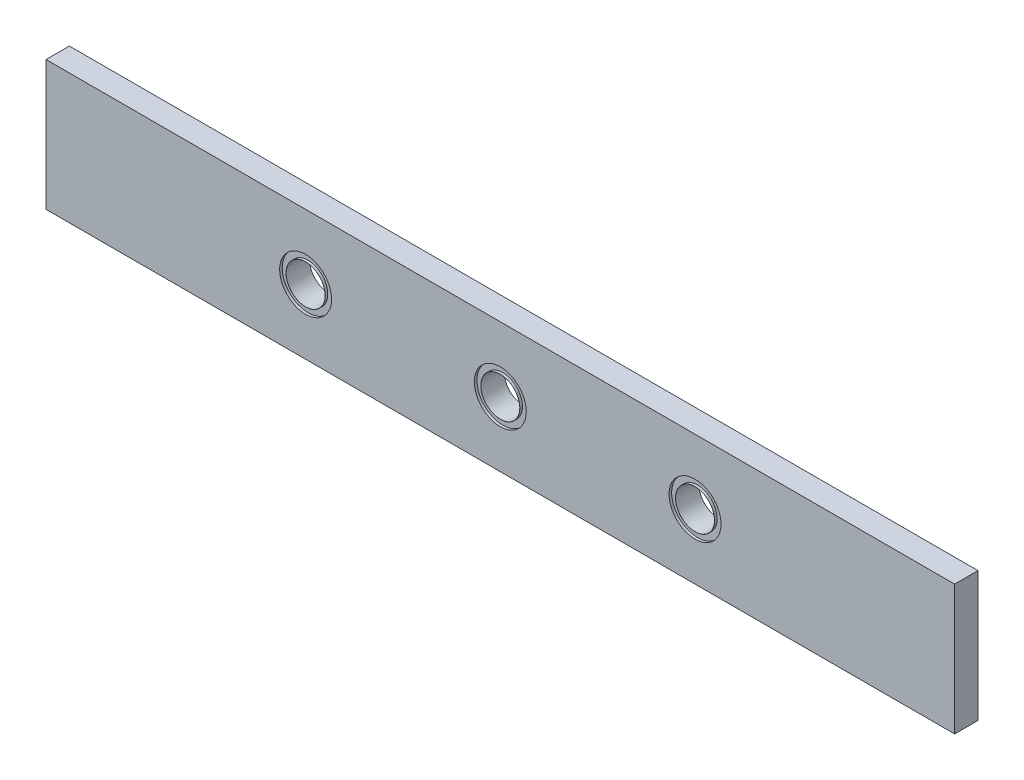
from build123d import *

# Parameters (mm, degrees)
SKETCH1_W           = 700
SKETCH1_H           = 100
BOSS_EXTRUDE1_DEPTH = 18
SKETCH2_R           = 15
CUT_EXTRUDE1_DEPTH  = 355.011299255
SKETCH3_R           = 15
CUT_EXTRUDE2_DEPTH  = 355.011299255
SKETCH4_R           = 20
SKETCH4_R_2         = 15.05
CUT_EXTRUDE3_DEPTH  = 2


with BuildPart() as part:
    # Sketch1 → Boss-Extrude1 (new body)
    with BuildSketch(Plane.XY):
        Rectangle(SKETCH1_W, SKETCH1_H)
    extrude(amount=BOSS_EXTRUDE1_DEPTH)

    # Sketch2 → Cut-Extrude1 (cut, through all)
    with BuildSketch(Plane.XY.offset(18)):
        with Locations((150, 0)):
            Circle(SKETCH2_R)
        with Locations(Location((-150, 0, 0), (0, 0, 180))):
            Circle(SKETCH2_R)
    extrude(amount=-CUT_EXTRUDE1_DEPTH, mode=Mode.SUBTRACT)

    # Sketch3 → Cut-Extrude2 (cut, through all)
    with BuildSketch(Plane.XY.offset(18)):
        Circle(SKETCH3_R)
    extrude(amount=-CUT_EXTRUDE2_DEPTH, mode=Mode.SUBTRACT)

    # Sketch4 → Cut-Extrude3 (cut)
    # profile 1 of 3: a face of its own
    with BuildSketch(Plane.XY.offset(18)):
        Circle(SKETCH4_R)
        Circle(SKETCH4_R_2, mode=Mode.SUBTRACT)
    # profile 2 of 3: a face of its own
    with BuildSketch(Plane.XY.offset(18)):
        with Locations((-150, 0)):
            Circle(SKETCH4_R)
        with Locations((-150, 0)):
            Circle(SKETCH4_R_2, mode=Mode.SUBTRACT)
    # profile 3 of 3: a face of its own
    with BuildSketch(Plane.XY.offset(18)):
        with Locations((150, 0)):
            Circle(SKETCH4_R)
        with Locations((150, 0)):
            Circle(SKETCH4_R_2, mode=Mode.SUBTRACT)
    cut_extrude3 = extrude(amount=-CUT_EXTRUDE3_DEPTH, mode=Mode.SUBTRACT)

    # Mirror1: Cut-Extrude3 across plane
    add(cut_extrude3.mirror(Plane.XY.offset(9)), mode=Mode.SUBTRACT)


solid = part.part
